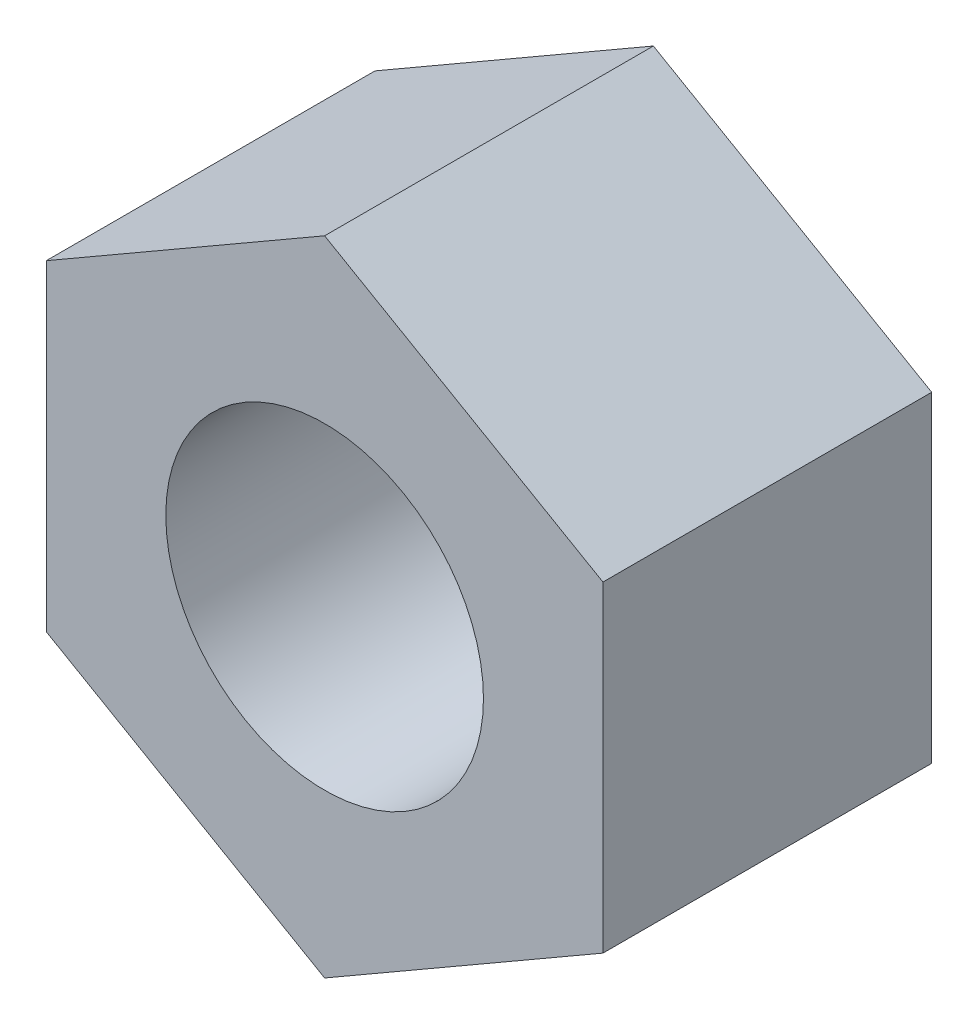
ISO-10303-21;
HEADER;
FILE_DESCRIPTION(('STEP AP214'),'2;1');
FILE_NAME('part.step','',(''),(''),'','','');
FILE_SCHEMA(('AUTOMOTIVE_DESIGN { 1 0 10303 214 1 1 1 1 }'));
ENDSEC;
DATA;
#1=APPLICATION_CONTEXT('core data for automotive mechanical design processes');
#2=APPLICATION_PROTOCOL_DEFINITION('international standard','automotive_design',2000,#1);
#3=PRODUCT_CONTEXT('',#1,'mechanical');
#4=PRODUCT('Part','Part','',(#3));
#5=PRODUCT_RELATED_PRODUCT_CATEGORY('part','',(#4));
#6=PRODUCT_DEFINITION_FORMATION('','',#4);
#7=PRODUCT_DEFINITION_CONTEXT('part definition',#1,'design');
#8=PRODUCT_DEFINITION('design','',#6,#7);
#9=PRODUCT_DEFINITION_SHAPE('','',#8);
#10=(LENGTH_UNIT() NAMED_UNIT(*) SI_UNIT(.MILLI.,.METRE.));
#11=(NAMED_UNIT(*) PLANE_ANGLE_UNIT() SI_UNIT($,.RADIAN.));
#12=(NAMED_UNIT(*) SI_UNIT($,.STERADIAN.) SOLID_ANGLE_UNIT());
#13=UNCERTAINTY_MEASURE_WITH_UNIT(LENGTH_MEASURE(1.E-05),#10,'distance_accuracy_value','');
#14=(GEOMETRIC_REPRESENTATION_CONTEXT(3) GLOBAL_UNCERTAINTY_ASSIGNED_CONTEXT((#13)) GLOBAL_UNIT_ASSIGNED_CONTEXT((#10,
#11,#12)) REPRESENTATION_CONTEXT('',''));
#15=CARTESIAN_POINT('',(0.,0.,0.));
#16=DIRECTION('',(0.,0.,1.));
#17=DIRECTION('',(1.,0.,0.));
#18=AXIS2_PLACEMENT_3D('',#15,#16,#17);
#19=CARTESIAN_POINT('',(0.,8.0949126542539,8.2804));
#20=DIRECTION('',(0.,0.,1.));
#21=DIRECTION('',(1.,0.,0.));
#22=AXIS2_PLACEMENT_3D('',#19,#20,#21);
#23=PLANE('',#22);
#24=DIRECTION('',(-0.866025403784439,0.5,0.));
#25=VECTOR('',#24,1.);
#26=CARTESIAN_POINT('',(7.01039999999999,4.04745632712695,8.2804));
#27=LINE('',#26,#25);
#28=CARTESIAN_POINT('',(7.01039999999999,4.04745632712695,8.2804));
#29=VERTEX_POINT('',#28);
#30=CARTESIAN_POINT('',(0.,8.0949126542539,8.2804));
#31=VERTEX_POINT('',#30);
#32=EDGE_CURVE('E116',#29,#31,#27,.T.);
#33=ORIENTED_EDGE('',*,*,#32,.T.);
#34=DIRECTION('',(-0.866025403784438,-0.500000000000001,0.));
#35=VECTOR('',#34,1.);
#36=CARTESIAN_POINT('',(0.,8.0949126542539,8.2804));
#37=LINE('',#36,#35);
#38=CARTESIAN_POINT('',(-7.0104,4.04745632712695,8.2804));
#39=VERTEX_POINT('',#38);
#40=EDGE_CURVE('E97',#31,#39,#37,.T.);
#41=ORIENTED_EDGE('',*,*,#40,.T.);
#42=DIRECTION('',(0.,-1.,0.));
#43=VECTOR('',#42,1.);
#44=CARTESIAN_POINT('',(-7.0104,4.04745632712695,8.2804));
#45=LINE('',#44,#43);
#46=CARTESIAN_POINT('',(-7.0104,-4.04745632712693,8.2804));
#47=VERTEX_POINT('',#46);
#48=EDGE_CURVE('E119',#39,#47,#45,.T.);
#49=ORIENTED_EDGE('',*,*,#48,.T.);
#50=DIRECTION('',(0.866025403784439,-0.5,0.));
#51=VECTOR('',#50,1.);
#52=CARTESIAN_POINT('',(-7.0104,-4.04745632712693,8.2804));
#53=LINE('',#52,#51);
#54=CARTESIAN_POINT('',(0.,-8.09491265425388,8.2804));
#55=VERTEX_POINT('',#54);
#56=EDGE_CURVE('E121',#47,#55,#53,.T.);
#57=ORIENTED_EDGE('',*,*,#56,.T.);
#58=DIRECTION('',(0.866025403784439,0.5,0.));
#59=VECTOR('',#58,1.);
#60=CARTESIAN_POINT('',(0.,-8.09491265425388,8.2804));
#61=LINE('',#60,#59);
#62=CARTESIAN_POINT('',(7.01039999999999,-4.04745632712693,8.2804));
#63=VERTEX_POINT('',#62);
#64=EDGE_CURVE('E50',#55,#63,#61,.T.);
#65=ORIENTED_EDGE('',*,*,#64,.T.);
#66=DIRECTION('',(0.,1.,0.));
#67=VECTOR('',#66,1.);
#68=CARTESIAN_POINT('',(7.01039999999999,-4.04745632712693,8.2804));
#69=LINE('',#68,#67);
#70=EDGE_CURVE('E45',#63,#29,#69,.T.);
#71=ORIENTED_EDGE('',*,*,#70,.T.);
#72=EDGE_LOOP('',(#33,#41,#49,#57,#65,#71));
#73=FACE_BOUND('',#72,.T.);
#74=CARTESIAN_POINT('',(0.,0.,8.2804));
#75=DIRECTION('',(0.,0.,1.));
#76=DIRECTION('',(1.,0.,0.));
#77=AXIS2_PLACEMENT_3D('',#74,#75,#76);
#78=CIRCLE('',#77,4.0005);
#79=CARTESIAN_POINT('',(4.0005,0.,8.2804));
#80=VERTEX_POINT('',#79);
#81=EDGE_CURVE('E102',#80,#80,#78,.T.);
#82=ORIENTED_EDGE('',*,*,#81,.F.);
#83=EDGE_LOOP('',(#82));
#84=FACE_BOUND('',#83,.T.);
#85=ADVANCED_FACE('F30',(#73,#84),#23,.T.);
#86=CARTESIAN_POINT('',(0.,8.0949126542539,0.));
#87=DIRECTION('',(0.,0.,1.));
#88=DIRECTION('',(1.,0.,0.));
#89=AXIS2_PLACEMENT_3D('',#86,#87,#88);
#90=PLANE('',#89);
#91=DIRECTION('',(-0.866025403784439,0.5,0.));
#92=VECTOR('',#91,1.);
#93=CARTESIAN_POINT('',(7.01039999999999,4.04745632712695,0.));
#94=LINE('',#93,#92);
#95=CARTESIAN_POINT('',(7.01039999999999,4.04745632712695,0.));
#96=VERTEX_POINT('',#95);
#97=CARTESIAN_POINT('',(0.,8.0949126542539,0.));
#98=VERTEX_POINT('',#97);
#99=EDGE_CURVE('E88',#96,#98,#94,.T.);
#100=ORIENTED_EDGE('',*,*,#99,.F.);
#101=DIRECTION('',(0.,1.,0.));
#102=VECTOR('',#101,1.);
#103=CARTESIAN_POINT('',(7.01039999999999,-4.04745632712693,0.));
#104=LINE('',#103,#102);
#105=CARTESIAN_POINT('',(7.01039999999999,-4.04745632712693,0.));
#106=VERTEX_POINT('',#105);
#107=EDGE_CURVE('E114',#106,#96,#104,.T.);
#108=ORIENTED_EDGE('',*,*,#107,.F.);
#109=DIRECTION('',(0.866025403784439,0.5,0.));
#110=VECTOR('',#109,1.);
#111=CARTESIAN_POINT('',(0.,-8.09491265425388,0.));
#112=LINE('',#111,#110);
#113=CARTESIAN_POINT('',(0.,-8.09491265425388,0.));
#114=VERTEX_POINT('',#113);
#115=EDGE_CURVE('E112',#114,#106,#112,.T.);
#116=ORIENTED_EDGE('',*,*,#115,.F.);
#117=DIRECTION('',(0.866025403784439,-0.5,0.));
#118=VECTOR('',#117,1.);
#119=CARTESIAN_POINT('',(-7.0104,-4.04745632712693,0.));
#120=LINE('',#119,#118);
#121=CARTESIAN_POINT('',(-7.0104,-4.04745632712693,0.));
#122=VERTEX_POINT('',#121);
#123=EDGE_CURVE('E110',#122,#114,#120,.T.);
#124=ORIENTED_EDGE('',*,*,#123,.F.);
#125=DIRECTION('',(0.,-1.,0.));
#126=VECTOR('',#125,1.);
#127=CARTESIAN_POINT('',(-7.0104,4.04745632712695,0.));
#128=LINE('',#127,#126);
#129=CARTESIAN_POINT('',(-7.0104,4.04745632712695,0.));
#130=VERTEX_POINT('',#129);
#131=EDGE_CURVE('E90',#130,#122,#128,.T.);
#132=ORIENTED_EDGE('',*,*,#131,.F.);
#133=DIRECTION('',(-0.866025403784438,-0.500000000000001,0.));
#134=VECTOR('',#133,1.);
#135=CARTESIAN_POINT('',(0.,8.0949126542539,0.));
#136=LINE('',#135,#134);
#137=EDGE_CURVE('E83',#98,#130,#136,.T.);
#138=ORIENTED_EDGE('',*,*,#137,.F.);
#139=EDGE_LOOP('',(#100,#108,#116,#124,#132,#138));
#140=FACE_BOUND('',#139,.T.);
#141=CARTESIAN_POINT('',(0.,0.,0.));
#142=DIRECTION('',(0.,0.,1.));
#143=DIRECTION('',(1.,0.,0.));
#144=AXIS2_PLACEMENT_3D('',#141,#142,#143);
#145=CIRCLE('',#144,4.0005);
#146=CARTESIAN_POINT('',(4.0005,0.,0.));
#147=VERTEX_POINT('',#146);
#148=EDGE_CURVE('E105',#147,#147,#145,.T.);
#149=ORIENTED_EDGE('',*,*,#148,.T.);
#150=EDGE_LOOP('',(#149));
#151=FACE_BOUND('',#150,.T.);
#152=ADVANCED_FACE('F84',(#140,#151),#90,.F.);
#153=CARTESIAN_POINT('',(7.01039999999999,4.04745632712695,8.2804));
#154=DIRECTION('',(-0.5,-0.866025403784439,0.));
#155=DIRECTION('',(0.866025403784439,-0.5,0.));
#156=AXIS2_PLACEMENT_3D('',#153,#154,#155);
#157=PLANE('',#156);
#158=ORIENTED_EDGE('',*,*,#99,.T.);
#159=DIRECTION('',(0.,0.,-1.));
#160=VECTOR('',#159,1.);
#161=CARTESIAN_POINT('',(0.,8.0949126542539,8.2804));
#162=LINE('',#161,#160);
#163=EDGE_CURVE('E11',#31,#98,#162,.T.);
#164=ORIENTED_EDGE('',*,*,#163,.F.);
#165=ORIENTED_EDGE('',*,*,#32,.F.);
#166=DIRECTION('',(0.,0.,-1.));
#167=VECTOR('',#166,1.);
#168=CARTESIAN_POINT('',(7.01039999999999,4.04745632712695,8.2804));
#169=LINE('',#168,#167);
#170=EDGE_CURVE('E101',#29,#96,#169,.T.);
#171=ORIENTED_EDGE('',*,*,#170,.T.);
#172=EDGE_LOOP('',(#158,#164,#165,#171));
#173=FACE_BOUND('',#172,.T.);
#174=ADVANCED_FACE('F32',(#173),#157,.F.);
#175=CARTESIAN_POINT('',(0.,8.0949126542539,8.2804));
#176=DIRECTION('',(0.500000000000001,-0.866025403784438,0.));
#177=DIRECTION('',(0.866025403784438,0.500000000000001,0.));
#178=AXIS2_PLACEMENT_3D('',#175,#176,#177);
#179=PLANE('',#178);
#180=ORIENTED_EDGE('',*,*,#137,.T.);
#181=DIRECTION('',(0.,0.,-1.));
#182=VECTOR('',#181,1.);
#183=CARTESIAN_POINT('',(-7.0104,4.04745632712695,8.2804));
#184=LINE('',#183,#182);
#185=EDGE_CURVE('E38',#39,#130,#184,.T.);
#186=ORIENTED_EDGE('',*,*,#185,.F.);
#187=ORIENTED_EDGE('',*,*,#40,.F.);
#188=ORIENTED_EDGE('',*,*,#163,.T.);
#189=EDGE_LOOP('',(#180,#186,#187,#188));
#190=FACE_BOUND('',#189,.T.);
#191=ADVANCED_FACE('F96',(#190),#179,.F.);
#192=CARTESIAN_POINT('',(-7.0104,4.04745632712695,8.2804));
#193=DIRECTION('',(1.,0.,0.));
#194=DIRECTION('',(0.,0.,-1.));
#195=AXIS2_PLACEMENT_3D('',#192,#193,#194);
#196=PLANE('',#195);
#197=ORIENTED_EDGE('',*,*,#131,.T.);
#198=DIRECTION('',(0.,0.,-1.));
#199=VECTOR('',#198,1.);
#200=CARTESIAN_POINT('',(-7.0104,-4.04745632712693,8.2804));
#201=LINE('',#200,#199);
#202=EDGE_CURVE('E132',#47,#122,#201,.T.);
#203=ORIENTED_EDGE('',*,*,#202,.F.);
#204=ORIENTED_EDGE('',*,*,#48,.F.);
#205=ORIENTED_EDGE('',*,*,#185,.T.);
#206=EDGE_LOOP('',(#197,#203,#204,#205));
#207=FACE_BOUND('',#206,.T.);
#208=ADVANCED_FACE('F136',(#207),#196,.F.);
#209=CARTESIAN_POINT('',(-7.0104,-4.04745632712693,8.2804));
#210=DIRECTION('',(0.5,0.866025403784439,0.));
#211=DIRECTION('',(-0.866025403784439,0.5,0.));
#212=AXIS2_PLACEMENT_3D('',#209,#210,#211);
#213=PLANE('',#212);
#214=ORIENTED_EDGE('',*,*,#123,.T.);
#215=DIRECTION('',(0.,0.,-1.));
#216=VECTOR('',#215,1.);
#217=CARTESIAN_POINT('',(0.,-8.09491265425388,8.2804));
#218=LINE('',#217,#216);
#219=EDGE_CURVE('E129',#55,#114,#218,.T.);
#220=ORIENTED_EDGE('',*,*,#219,.F.);
#221=ORIENTED_EDGE('',*,*,#56,.F.);
#222=ORIENTED_EDGE('',*,*,#202,.T.);
#223=EDGE_LOOP('',(#214,#220,#221,#222));
#224=FACE_BOUND('',#223,.T.);
#225=ADVANCED_FACE('F142',(#224),#213,.F.);
#226=CARTESIAN_POINT('',(0.,-8.09491265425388,8.2804));
#227=DIRECTION('',(-0.5,0.866025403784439,0.));
#228=DIRECTION('',(-0.866025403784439,-0.5,0.));
#229=AXIS2_PLACEMENT_3D('',#226,#227,#228);
#230=PLANE('',#229);
#231=ORIENTED_EDGE('',*,*,#115,.T.);
#232=DIRECTION('',(0.,0.,-1.));
#233=VECTOR('',#232,1.);
#234=CARTESIAN_POINT('',(7.01039999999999,-4.04745632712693,8.2804));
#235=LINE('',#234,#233);
#236=EDGE_CURVE('E126',#63,#106,#235,.T.);
#237=ORIENTED_EDGE('',*,*,#236,.F.);
#238=ORIENTED_EDGE('',*,*,#64,.F.);
#239=ORIENTED_EDGE('',*,*,#219,.T.);
#240=EDGE_LOOP('',(#231,#237,#238,#239));
#241=FACE_BOUND('',#240,.T.);
#242=ADVANCED_FACE('F145',(#241),#230,.F.);
#243=CARTESIAN_POINT('',(7.01039999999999,-4.04745632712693,8.2804));
#244=DIRECTION('',(-1.,0.,0.));
#245=DIRECTION('',(0.,0.,1.));
#246=AXIS2_PLACEMENT_3D('',#243,#244,#245);
#247=PLANE('',#246);
#248=ORIENTED_EDGE('',*,*,#107,.T.);
#249=ORIENTED_EDGE('',*,*,#170,.F.);
#250=ORIENTED_EDGE('',*,*,#70,.F.);
#251=ORIENTED_EDGE('',*,*,#236,.T.);
#252=EDGE_LOOP('',(#248,#249,#250,#251));
#253=FACE_BOUND('',#252,.T.);
#254=ADVANCED_FACE('F147',(#253),#247,.F.);
#255=CARTESIAN_POINT('',(0.,0.,8.2804));
#256=DIRECTION('',(0.,0.,-1.));
#257=DIRECTION('',(-1.,0.,0.));
#258=AXIS2_PLACEMENT_3D('',#255,#256,#257);
#259=CYLINDRICAL_SURFACE('',#258,4.0005);
#260=ORIENTED_EDGE('',*,*,#81,.T.);
#261=EDGE_LOOP('',(#260));
#262=FACE_BOUND('',#261,.T.);
#263=ORIENTED_EDGE('',*,*,#148,.F.);
#264=EDGE_LOOP('',(#263));
#265=FACE_BOUND('',#264,.T.);
#266=ADVANCED_FACE('F149',(#262,#265),#259,.F.);
#267=CLOSED_SHELL('',(#85,#152,#174,#191,#208,#225,#242,#254,#266));
#268=MANIFOLD_SOLID_BREP('B2',#267);
#269=ADVANCED_BREP_SHAPE_REPRESENTATION('',(#18,#268),#14);
#270=SHAPE_DEFINITION_REPRESENTATION(#9,#269);
ENDSEC;
END-ISO-10303-21;
